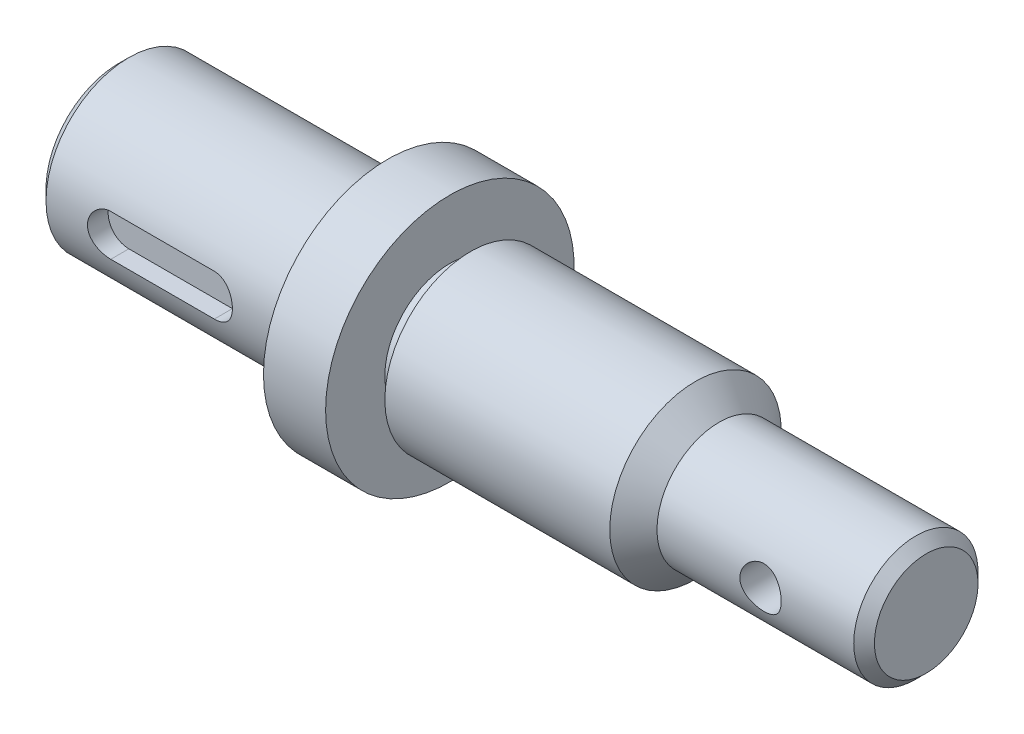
ISO-10303-21;
HEADER;
FILE_DESCRIPTION(('STEP AP214'),'2;1');
FILE_NAME('part.step','',(''),(''),'','','');
FILE_SCHEMA(('AUTOMOTIVE_DESIGN { 1 0 10303 214 1 1 1 1 }'));
ENDSEC;
DATA;
#1=APPLICATION_CONTEXT('core data for automotive mechanical design processes');
#2=APPLICATION_PROTOCOL_DEFINITION('international standard','automotive_design',2000,#1);
#3=PRODUCT_CONTEXT('',#1,'mechanical');
#4=PRODUCT('Part','Part','',(#3));
#5=PRODUCT_RELATED_PRODUCT_CATEGORY('part','',(#4));
#6=PRODUCT_DEFINITION_FORMATION('','',#4);
#7=PRODUCT_DEFINITION_CONTEXT('part definition',#1,'design');
#8=PRODUCT_DEFINITION('design','',#6,#7);
#9=PRODUCT_DEFINITION_SHAPE('','',#8);
#10=(LENGTH_UNIT() NAMED_UNIT(*) SI_UNIT(.MILLI.,.METRE.));
#11=(NAMED_UNIT(*) PLANE_ANGLE_UNIT() SI_UNIT($,.RADIAN.));
#12=(NAMED_UNIT(*) SI_UNIT($,.STERADIAN.) SOLID_ANGLE_UNIT());
#13=UNCERTAINTY_MEASURE_WITH_UNIT(LENGTH_MEASURE(1.E-05),#10,'distance_accuracy_value','');
#14=(GEOMETRIC_REPRESENTATION_CONTEXT(3) GLOBAL_UNCERTAINTY_ASSIGNED_CONTEXT((#13)) GLOBAL_UNIT_ASSIGNED_CONTEXT((#10,
#11,#12)) REPRESENTATION_CONTEXT('',''));
#15=CARTESIAN_POINT('',(0.,0.,0.));
#16=DIRECTION('',(0.,0.,1.));
#17=DIRECTION('',(1.,0.,0.));
#18=AXIS2_PLACEMENT_3D('',#15,#16,#17);
#19=CARTESIAN_POINT('',(0.,0.,0.));
#20=DIRECTION('',(1.,0.,0.));
#21=DIRECTION('',(0.,0.,-1.));
#22=AXIS2_PLACEMENT_3D('',#19,#20,#21);
#23=PLANE('',#22);
#24=CARTESIAN_POINT('',(0.,0.,0.));
#25=DIRECTION('',(1.,0.,0.));
#26=DIRECTION('',(0.,0.,-1.));
#27=AXIS2_PLACEMENT_3D('',#24,#25,#26);
#28=CIRCLE('',#27,3.5);
#29=CARTESIAN_POINT('',(0.,0.,-3.5));
#30=VERTEX_POINT('',#29);
#31=EDGE_CURVE('E138',#30,#30,#28,.F.);
#32=ORIENTED_EDGE('',*,*,#31,.T.);
#33=EDGE_LOOP('',(#32));
#34=FACE_BOUND('',#33,.T.);
#35=ADVANCED_FACE('F31',(#34),#23,.F.);
#36=CARTESIAN_POINT('',(-89.9218390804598,0.,0.));
#37=DIRECTION('',(-1.,0.,0.));
#38=DIRECTION('',(0.,0.,1.));
#39=AXIS2_PLACEMENT_3D('',#36,#37,#38);
#40=CYLINDRICAL_SURFACE('',#39,4.);
#41=DIRECTION('',(-1.,0.,0.));
#42=VECTOR('',#41,1.);
#43=CARTESIAN_POINT('',(-89.9218390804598,1.,3.87298334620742));
#44=LINE('',#43,#42);
#45=CARTESIAN_POINT('',(3.5,1.,3.87298334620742));
#46=VERTEX_POINT('',#45);
#47=CARTESIAN_POINT('',(8.5,1.,3.87298334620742));
#48=VERTEX_POINT('',#47);
#49=EDGE_CURVE('E11',#46,#48,#44,.F.);
#50=ORIENTED_EDGE('',*,*,#49,.T.);
#51=CARTESIAN_POINT('',(8.5,1.,3.87298334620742));
#52=CARTESIAN_POINT('',(8.52766298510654,1.00000033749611,3.87298148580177));
#53=CARTESIAN_POINT('',(8.55531226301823,0.998851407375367,3.87328009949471));
#54=CARTESIAN_POINT('',(8.61040403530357,0.994271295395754,3.87445904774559));
#55=CARTESIAN_POINT('',(8.63784656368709,0.990840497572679,3.87533928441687));
#56=CARTESIAN_POINT('',(8.71945317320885,0.977175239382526,3.87881710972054));
#57=CARTESIAN_POINT('',(8.77305646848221,0.963567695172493,3.88225203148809));
#58=CARTESIAN_POINT('',(8.87712467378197,0.927798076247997,3.89095422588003));
#59=CARTESIAN_POINT('',(8.92758987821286,0.905636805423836,3.8962213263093));
#60=CARTESIAN_POINT('',(9.02411144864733,0.853415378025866,3.90799134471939));
#61=CARTESIAN_POINT('',(9.07016662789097,0.823353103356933,3.91449459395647));
#62=CARTESIAN_POINT('',(9.1575438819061,0.755484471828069,3.92816262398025));
#63=CARTESIAN_POINT('',(9.19875488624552,0.717537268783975,3.93533791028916));
#64=CARTESIAN_POINT('',(9.27430208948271,0.635275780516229,3.94945104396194));
#65=CARTESIAN_POINT('',(9.30863718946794,0.59096047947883,3.95638885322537));
#66=CARTESIAN_POINT('',(9.36991100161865,0.496456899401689,3.96936182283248));
#67=CARTESIAN_POINT('',(9.39673989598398,0.446195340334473,3.9753830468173));
#68=CARTESIAN_POINT('',(9.44152473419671,0.341702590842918,3.98572346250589));
#69=CARTESIAN_POINT('',(9.45948242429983,0.287472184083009,3.99004298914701));
#70=CARTESIAN_POINT('',(9.48565899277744,0.177744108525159,3.99641900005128));
#71=CARTESIAN_POINT('',(9.49406767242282,0.122294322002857,3.99851952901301));
#72=CARTESIAN_POINT('',(9.5015033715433,0.0107327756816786,4.00037438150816));
#73=CARTESIAN_POINT('',(9.50053157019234,-0.0453789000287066,4.00012899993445));
#74=CARTESIAN_POINT('',(9.48937003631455,-0.155352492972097,3.99735237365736));
#75=CARTESIAN_POINT('',(9.47938538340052,-0.209236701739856,3.99487198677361));
#76=CARTESIAN_POINT('',(9.45081132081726,-0.314538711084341,3.98796330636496));
#77=CARTESIAN_POINT('',(9.43222153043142,-0.365956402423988,3.98353492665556));
#78=CARTESIAN_POINT('',(9.38679871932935,-0.46540728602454,3.97314997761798));
#79=CARTESIAN_POINT('',(9.35989260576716,-0.51340562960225,3.96717993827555));
#80=CARTESIAN_POINT('',(9.29865687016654,-0.604276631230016,3.95435945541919));
#81=CARTESIAN_POINT('',(9.26432612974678,-0.64714851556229,3.94750887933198));
#82=CARTESIAN_POINT('',(9.18812108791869,-0.727769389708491,3.93345566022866));
#83=CARTESIAN_POINT('',(9.14606836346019,-0.765349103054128,3.92624850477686));
#84=CARTESIAN_POINT('',(9.05617013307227,-0.832969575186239,3.91246168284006));
#85=CARTESIAN_POINT('',(9.00832304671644,-0.863008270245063,3.90588218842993));
#86=CARTESIAN_POINT('',(8.90785440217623,-0.914804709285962,3.89407813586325));
#87=CARTESIAN_POINT('',(8.85520853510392,-0.93651701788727,3.88886106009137));
#88=CARTESIAN_POINT('',(8.74688307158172,-0.970702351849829,3.88047058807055));
#89=CARTESIAN_POINT('',(8.69120814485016,-0.983189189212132,3.87729413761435));
#90=CARTESIAN_POINT('',(8.6125426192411,-0.993904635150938,3.87455290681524));
#91=CARTESIAN_POINT('',(8.59008029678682,-0.996190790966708,3.8739652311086));
#92=CARTESIAN_POINT('',(8.54508221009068,-0.999236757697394,3.87318062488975));
#93=CARTESIAN_POINT('',(8.52254662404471,-0.999999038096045,3.87298306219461));
#94=CARTESIAN_POINT('',(8.5,-1.,3.87298334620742));
#95=B_SPLINE_CURVE_WITH_KNOTS('',3,(#51,#52,#53,#54,#55,#56,#57,#58,#59,#60,#61,#62,#63,#64,#65,
#66,#67,#68,#69,#70,#71,#72,#73,#74,#75,#76,#77,#78,#79,#80,#81,#82,#83,#84,#85,#86,#87,#88,#89,
#90,#91,#92,#93,#94),.UNSPECIFIED.,.F.,.F.,(4,2,2,2,2,2,2,2,2,2,2,2,2,2,2,2,2,2,2,2,2,4),(0.,
0.082936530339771,0.165859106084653,0.331229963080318,0.496585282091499,0.66198497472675,
0.830641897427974,0.999325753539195,1.17036187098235,1.34136430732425,1.50890481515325,
1.67642426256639,1.84022545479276,2.00403389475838,2.16932509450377,2.33464120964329,
2.50441429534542,2.67423379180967,2.84496720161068,3.01544447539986,3.08315848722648,
3.15076267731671),.UNSPECIFIED.);
#96=CARTESIAN_POINT('',(8.5,-1.,3.87298334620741));
#97=VERTEX_POINT('',#96);
#98=EDGE_CURVE('E150',#48,#97,#95,.T.);
#99=ORIENTED_EDGE('',*,*,#98,.T.);
#100=DIRECTION('',(-1.,0.,0.));
#101=VECTOR('',#100,1.);
#102=CARTESIAN_POINT('',(-89.9218390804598,-1.00000000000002,3.87298334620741));
#103=LINE('',#102,#101);
#104=CARTESIAN_POINT('',(3.5,-1.00000000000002,3.87298334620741));
#105=VERTEX_POINT('',#104);
#106=EDGE_CURVE('E44',#97,#105,#103,.T.);
#107=ORIENTED_EDGE('',*,*,#106,.T.);
#108=CARTESIAN_POINT('',(3.5,-1.,3.87298334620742));
#109=CARTESIAN_POINT('',(3.47233701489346,-1.00000033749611,3.87298148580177));
#110=CARTESIAN_POINT('',(3.44468773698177,-0.998851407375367,3.87328009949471));
#111=CARTESIAN_POINT('',(3.38959596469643,-0.994271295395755,3.87445904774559));
#112=CARTESIAN_POINT('',(3.36215343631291,-0.99084049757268,3.87533928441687));
#113=CARTESIAN_POINT('',(3.28054682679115,-0.977175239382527,3.87881710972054));
#114=CARTESIAN_POINT('',(3.22694353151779,-0.963567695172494,3.88225203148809));
#115=CARTESIAN_POINT('',(3.12287532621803,-0.927798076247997,3.89095422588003));
#116=CARTESIAN_POINT('',(3.07241012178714,-0.905636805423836,3.8962213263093));
#117=CARTESIAN_POINT('',(2.97588855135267,-0.853415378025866,3.90799134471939));
#118=CARTESIAN_POINT('',(2.92983337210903,-0.823353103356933,3.91449459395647));
#119=CARTESIAN_POINT('',(2.8424561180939,-0.755484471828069,3.92816262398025));
#120=CARTESIAN_POINT('',(2.80124511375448,-0.717537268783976,3.93533791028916));
#121=CARTESIAN_POINT('',(2.72569791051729,-0.63527578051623,3.94945104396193));
#122=CARTESIAN_POINT('',(2.69136281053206,-0.590960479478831,3.95638885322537));
#123=CARTESIAN_POINT('',(2.63008899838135,-0.496456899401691,3.96936182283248));
#124=CARTESIAN_POINT('',(2.60326010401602,-0.446195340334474,3.9753830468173));
#125=CARTESIAN_POINT('',(2.55847526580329,-0.341702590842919,3.98572346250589));
#126=CARTESIAN_POINT('',(2.54051757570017,-0.28747218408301,3.99004298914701));
#127=CARTESIAN_POINT('',(2.51434100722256,-0.17774410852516,3.99641900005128));
#128=CARTESIAN_POINT('',(2.50593232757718,-0.122294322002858,3.99851952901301));
#129=CARTESIAN_POINT('',(2.4984966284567,-0.0107327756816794,4.00037438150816));
#130=CARTESIAN_POINT('',(2.49946842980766,0.0453789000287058,4.00012899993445));
#131=CARTESIAN_POINT('',(2.51062996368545,0.155352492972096,3.99735237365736));
#132=CARTESIAN_POINT('',(2.52061461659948,0.209236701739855,3.99487198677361));
#133=CARTESIAN_POINT('',(2.54918867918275,0.31453871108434,3.98796330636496));
#134=CARTESIAN_POINT('',(2.56777846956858,0.365956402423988,3.98353492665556));
#135=CARTESIAN_POINT('',(2.61320128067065,0.465407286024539,3.97314997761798));
#136=CARTESIAN_POINT('',(2.64010739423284,0.513405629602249,3.96717993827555));
#137=CARTESIAN_POINT('',(2.70134312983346,0.604276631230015,3.95435945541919));
#138=CARTESIAN_POINT('',(2.73567387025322,0.647148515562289,3.94750887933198));
#139=CARTESIAN_POINT('',(2.81187891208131,0.727769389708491,3.93345566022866));
#140=CARTESIAN_POINT('',(2.85393163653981,0.765349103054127,3.92624850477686));
#141=CARTESIAN_POINT('',(2.94382986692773,0.832969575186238,3.91246168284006));
#142=CARTESIAN_POINT('',(2.99167695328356,0.863008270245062,3.90588218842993));
#143=CARTESIAN_POINT('',(3.09214559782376,0.914804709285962,3.89407813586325));
#144=CARTESIAN_POINT('',(3.14479146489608,0.93651701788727,3.88886106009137));
#145=CARTESIAN_POINT('',(3.25311692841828,0.970702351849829,3.88047058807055));
#146=CARTESIAN_POINT('',(3.30879185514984,0.983189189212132,3.87729413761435));
#147=CARTESIAN_POINT('',(3.3874573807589,0.993904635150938,3.87455290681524));
#148=CARTESIAN_POINT('',(3.40991970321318,0.996190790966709,3.8739652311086));
#149=CARTESIAN_POINT('',(3.45491778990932,0.999236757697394,3.87318062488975));
#150=CARTESIAN_POINT('',(3.47745337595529,0.999999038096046,3.87298306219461));
#151=CARTESIAN_POINT('',(3.5,1.,3.87298334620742));
#152=B_SPLINE_CURVE_WITH_KNOTS('',3,(#108,#109,#110,#111,#112,#113,#114,#115,#116,#117,#118,
#119,#120,#121,#122,#123,#124,#125,#126,#127,#128,#129,#130,#131,#132,#133,#134,#135,#136,#137,
#138,#139,#140,#141,#142,#143,#144,#145,#146,#147,#148,#149,#150,#151),.UNSPECIFIED.,.F.,.F.,(4,
2,2,2,2,2,2,2,2,2,2,2,2,2,2,2,2,2,2,2,2,4),(0.,0.0829365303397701,0.165859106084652,
0.331229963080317,0.496585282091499,0.66198497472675,0.830641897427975,0.999325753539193,
1.17036187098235,1.34136430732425,1.50890481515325,1.67642426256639,1.84022545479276,
2.00403389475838,2.16932509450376,2.33464120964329,2.50441429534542,2.67423379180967,
2.84496720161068,3.01544447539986,3.08315848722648,3.15076267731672),.UNSPECIFIED.);
#153=EDGE_CURVE('E52',#105,#46,#152,.T.);
#154=ORIENTED_EDGE('',*,*,#153,.T.);
#155=EDGE_LOOP('',(#50,#99,#107,#154));
#156=FACE_BOUND('',#155,.T.);
#157=CARTESIAN_POINT('',(0.5,0.,0.));
#158=DIRECTION('',(1.,0.,0.));
#159=DIRECTION('',(0.,0.,-1.));
#160=AXIS2_PLACEMENT_3D('',#157,#158,#159);
#161=CIRCLE('',#160,4.);
#162=CARTESIAN_POINT('',(0.5,0.,-4.));
#163=VERTEX_POINT('',#162);
#164=EDGE_CURVE('E141',#163,#163,#161,.T.);
#165=ORIENTED_EDGE('',*,*,#164,.T.);
#166=EDGE_LOOP('',(#165));
#167=FACE_BOUND('',#166,.T.);
#168=CARTESIAN_POINT('',(12.,0.,0.));
#169=DIRECTION('',(-1.,0.,0.));
#170=DIRECTION('',(0.,0.,1.));
#171=AXIS2_PLACEMENT_3D('',#168,#169,#170);
#172=CIRCLE('',#171,4.);
#173=CARTESIAN_POINT('',(12.,0.,4.));
#174=VERTEX_POINT('',#173);
#175=EDGE_CURVE('E135',#174,#174,#172,.T.);
#176=ORIENTED_EDGE('',*,*,#175,.T.);
#177=EDGE_LOOP('',(#176));
#178=FACE_BOUND('',#177,.T.);
#179=ADVANCED_FACE('F163',(#156,#167,#178),#40,.T.);
#180=CARTESIAN_POINT('',(12.,4.,0.));
#181=DIRECTION('',(-1.,0.,0.));
#182=DIRECTION('',(0.,0.,1.));
#183=AXIS2_PLACEMENT_3D('',#180,#181,#182);
#184=PLANE('',#183);
#185=ORIENTED_EDGE('',*,*,#175,.F.);
#186=EDGE_LOOP('',(#185));
#187=FACE_BOUND('',#186,.T.);
#188=CARTESIAN_POINT('',(12.,0.,0.));
#189=DIRECTION('',(-1.,0.,0.));
#190=DIRECTION('',(0.,0.,1.));
#191=AXIS2_PLACEMENT_3D('',#188,#189,#190);
#192=CIRCLE('',#191,3.);
#193=CARTESIAN_POINT('',(12.,0.,3.));
#194=VERTEX_POINT('',#193);
#195=EDGE_CURVE('E132',#194,#194,#192,.T.);
#196=ORIENTED_EDGE('',*,*,#195,.T.);
#197=EDGE_LOOP('',(#196));
#198=FACE_BOUND('',#197,.T.);
#199=ADVANCED_FACE('F207',(#187,#198),#184,.F.);
#200=CARTESIAN_POINT('',(-89.9218390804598,0.,0.));
#201=DIRECTION('',(-1.,0.,0.));
#202=DIRECTION('',(0.,0.,1.));
#203=AXIS2_PLACEMENT_3D('',#200,#201,#202);
#204=CYLINDRICAL_SURFACE('',#203,3.);
#205=ORIENTED_EDGE('',*,*,#195,.F.);
#206=EDGE_LOOP('',(#205));
#207=FACE_BOUND('',#206,.T.);
#208=CARTESIAN_POINT('',(13.,0.,0.));
#209=DIRECTION('',(-1.,0.,0.));
#210=DIRECTION('',(0.,0.,1.));
#211=AXIS2_PLACEMENT_3D('',#208,#209,#210);
#212=CIRCLE('',#211,3.);
#213=CARTESIAN_POINT('',(13.,0.,3.));
#214=VERTEX_POINT('',#213);
#215=EDGE_CURVE('E129',#214,#214,#212,.T.);
#216=ORIENTED_EDGE('',*,*,#215,.T.);
#217=EDGE_LOOP('',(#216));
#218=FACE_BOUND('',#217,.T.);
#219=ADVANCED_FACE('F224',(#207,#218),#204,.T.);
#220=CARTESIAN_POINT('',(13.,3.,0.));
#221=DIRECTION('',(1.,0.,0.));
#222=DIRECTION('',(0.,0.,-1.));
#223=AXIS2_PLACEMENT_3D('',#220,#221,#222);
#224=PLANE('',#223);
#225=ORIENTED_EDGE('',*,*,#215,.F.);
#226=EDGE_LOOP('',(#225));
#227=FACE_BOUND('',#226,.T.);
#228=CARTESIAN_POINT('',(13.,0.,0.));
#229=DIRECTION('',(-1.,0.,0.));
#230=DIRECTION('',(0.,0.,1.));
#231=AXIS2_PLACEMENT_3D('',#228,#229,#230);
#232=CIRCLE('',#231,6.);
#233=CARTESIAN_POINT('',(13.,0.,6.));
#234=VERTEX_POINT('',#233);
#235=EDGE_CURVE('E126',#234,#234,#232,.T.);
#236=ORIENTED_EDGE('',*,*,#235,.T.);
#237=EDGE_LOOP('',(#236));
#238=FACE_BOUND('',#237,.T.);
#239=ADVANCED_FACE('F229',(#227,#238),#224,.F.);
#240=CARTESIAN_POINT('',(-89.9218390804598,0.,0.));
#241=DIRECTION('',(-1.,0.,0.));
#242=DIRECTION('',(0.,0.,1.));
#243=AXIS2_PLACEMENT_3D('',#240,#241,#242);
#244=CYLINDRICAL_SURFACE('',#243,6.);
#245=ORIENTED_EDGE('',*,*,#235,.F.);
#246=EDGE_LOOP('',(#245));
#247=FACE_BOUND('',#246,.T.);
#248=CARTESIAN_POINT('',(16.,0.,0.));
#249=DIRECTION('',(-1.,0.,0.));
#250=DIRECTION('',(0.,0.,1.));
#251=AXIS2_PLACEMENT_3D('',#248,#249,#250);
#252=CIRCLE('',#251,6.);
#253=CARTESIAN_POINT('',(16.,0.,6.));
#254=VERTEX_POINT('',#253);
#255=EDGE_CURVE('E123',#254,#254,#252,.T.);
#256=ORIENTED_EDGE('',*,*,#255,.T.);
#257=EDGE_LOOP('',(#256));
#258=FACE_BOUND('',#257,.T.);
#259=ADVANCED_FACE('F235',(#247,#258),#244,.T.);
#260=CARTESIAN_POINT('',(16.,6.,0.));
#261=DIRECTION('',(-1.,0.,0.));
#262=DIRECTION('',(0.,0.,1.));
#263=AXIS2_PLACEMENT_3D('',#260,#261,#262);
#264=PLANE('',#263);
#265=ORIENTED_EDGE('',*,*,#255,.F.);
#266=EDGE_LOOP('',(#265));
#267=FACE_BOUND('',#266,.T.);
#268=CARTESIAN_POINT('',(16.,0.,0.));
#269=DIRECTION('',(-1.,0.,0.));
#270=DIRECTION('',(0.,0.,1.));
#271=AXIS2_PLACEMENT_3D('',#268,#269,#270);
#272=CIRCLE('',#271,3.1400325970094);
#273=CARTESIAN_POINT('',(16.,0.,3.1400325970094));
#274=VERTEX_POINT('',#273);
#275=EDGE_CURVE('E120',#274,#274,#272,.T.);
#276=ORIENTED_EDGE('',*,*,#275,.T.);
#277=EDGE_LOOP('',(#276));
#278=FACE_BOUND('',#277,.T.);
#279=ADVANCED_FACE('F241',(#267,#278),#264,.F.);
#280=CARTESIAN_POINT('',(-89.9218390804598,0.,0.));
#281=DIRECTION('',(-1.,0.,0.));
#282=DIRECTION('',(0.,0.,1.));
#283=AXIS2_PLACEMENT_3D('',#280,#281,#282);
#284=CYLINDRICAL_SURFACE('',#283,3.1400325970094);
#285=ORIENTED_EDGE('',*,*,#275,.F.);
#286=EDGE_LOOP('',(#285));
#287=FACE_BOUND('',#286,.T.);
#288=CARTESIAN_POINT('',(17.,0.,0.));
#289=DIRECTION('',(-1.,0.,0.));
#290=DIRECTION('',(0.,0.,1.));
#291=AXIS2_PLACEMENT_3D('',#288,#289,#290);
#292=CIRCLE('',#291,3.1400325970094);
#293=CARTESIAN_POINT('',(17.,0.,3.1400325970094));
#294=VERTEX_POINT('',#293);
#295=EDGE_CURVE('E117',#294,#294,#292,.T.);
#296=ORIENTED_EDGE('',*,*,#295,.T.);
#297=EDGE_LOOP('',(#296));
#298=FACE_BOUND('',#297,.T.);
#299=ADVANCED_FACE('F247',(#287,#298),#284,.T.);
#300=CARTESIAN_POINT('',(17.,3.1400325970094,0.));
#301=DIRECTION('',(1.,0.,0.));
#302=DIRECTION('',(0.,0.,-1.));
#303=AXIS2_PLACEMENT_3D('',#300,#301,#302);
#304=PLANE('',#303);
#305=ORIENTED_EDGE('',*,*,#295,.F.);
#306=EDGE_LOOP('',(#305));
#307=FACE_BOUND('',#306,.T.);
#308=CARTESIAN_POINT('',(17.,0.,0.));
#309=DIRECTION('',(-1.,0.,0.));
#310=DIRECTION('',(0.,0.,1.));
#311=AXIS2_PLACEMENT_3D('',#308,#309,#310);
#312=CIRCLE('',#311,4.1400325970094);
#313=CARTESIAN_POINT('',(17.,0.,4.1400325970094));
#314=VERTEX_POINT('',#313);
#315=EDGE_CURVE('E114',#314,#314,#312,.T.);
#316=ORIENTED_EDGE('',*,*,#315,.T.);
#317=EDGE_LOOP('',(#316));
#318=FACE_BOUND('',#317,.T.);
#319=ADVANCED_FACE('F253',(#307,#318),#304,.F.);
#320=CARTESIAN_POINT('',(-89.9218390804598,0.,0.));
#321=DIRECTION('',(-1.,0.,0.));
#322=DIRECTION('',(0.,0.,1.));
#323=AXIS2_PLACEMENT_3D('',#320,#321,#322);
#324=CYLINDRICAL_SURFACE('',#323,4.1400325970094);
#325=ORIENTED_EDGE('',*,*,#315,.F.);
#326=EDGE_LOOP('',(#325));
#327=FACE_BOUND('',#326,.T.);
#328=CARTESIAN_POINT('',(27.8599674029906,0.,0.));
#329=DIRECTION('',(-1.,0.,0.));
#330=DIRECTION('',(0.,0.,1.));
#331=AXIS2_PLACEMENT_3D('',#328,#329,#330);
#332=CIRCLE('',#331,4.1400325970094);
#333=CARTESIAN_POINT('',(27.8599674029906,0.,4.1400325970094));
#334=VERTEX_POINT('',#333);
#335=EDGE_CURVE('E111',#334,#334,#332,.T.);
#336=ORIENTED_EDGE('',*,*,#335,.T.);
#337=EDGE_LOOP('',(#336));
#338=FACE_BOUND('',#337,.T.);
#339=ADVANCED_FACE('F259',(#327,#338),#324,.T.);
#340=CARTESIAN_POINT('',(29.,0.,0.));
#341=DIRECTION('',(-1.,0.,0.));
#342=DIRECTION('',(0.,0.,1.));
#343=AXIS2_PLACEMENT_3D('',#340,#341,#342);
#344=CONICAL_SURFACE('',#343,3.,0.785398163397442);
#345=ORIENTED_EDGE('',*,*,#335,.F.);
#346=EDGE_LOOP('',(#345));
#347=FACE_BOUND('',#346,.T.);
#348=CARTESIAN_POINT('',(29.,0.,0.));
#349=DIRECTION('',(-1.,0.,0.));
#350=DIRECTION('',(0.,0.,1.));
#351=AXIS2_PLACEMENT_3D('',#348,#349,#350);
#352=CIRCLE('',#351,3.);
#353=CARTESIAN_POINT('',(29.,0.,3.));
#354=VERTEX_POINT('',#353);
#355=EDGE_CURVE('E105',#354,#354,#352,.T.);
#356=ORIENTED_EDGE('',*,*,#355,.T.);
#357=EDGE_LOOP('',(#356));
#358=FACE_BOUND('',#357,.T.);
#359=ADVANCED_FACE('F187',(#347,#358),#344,.T.);
#360=CARTESIAN_POINT('',(-89.9218390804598,0.,0.));
#361=DIRECTION('',(-1.,0.,0.));
#362=DIRECTION('',(0.,0.,1.));
#363=AXIS2_PLACEMENT_3D('',#360,#361,#362);
#364=CYLINDRICAL_SURFACE('',#363,3.);
#365=CARTESIAN_POINT('',(35.,0.,3.));
#366=CARTESIAN_POINT('',(35.0000002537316,-0.0545633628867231,3.00000015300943));
#367=CARTESIAN_POINT('',(34.9955197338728,-0.10912519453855,2.99849769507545));
#368=CARTESIAN_POINT('',(34.9777708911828,-0.216641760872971,2.99265210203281));
#369=CARTESIAN_POINT('',(34.9645016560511,-0.269596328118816,2.98830867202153));
#370=CARTESIAN_POINT('',(34.929680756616,-0.372332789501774,2.97725307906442));
#371=CARTESIAN_POINT('',(34.9081429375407,-0.422119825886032,2.97054487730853));
#372=CARTESIAN_POINT('',(34.8574588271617,-0.517374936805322,2.95544445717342));
#373=CARTESIAN_POINT('',(34.8283110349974,-0.562842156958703,2.94705190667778));
#374=CARTESIAN_POINT('',(34.7621741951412,-0.649741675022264,2.92914094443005));
#375=CARTESIAN_POINT('',(34.7249687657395,-0.691003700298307,2.91959556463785));
#376=CARTESIAN_POINT('',(34.6442328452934,-0.766832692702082,2.90060314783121));
#377=CARTESIAN_POINT('',(34.6007009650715,-0.801398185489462,2.89115613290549));
#378=CARTESIAN_POINT('',(34.5070148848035,-0.863824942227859,2.87313332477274));
#379=CARTESIAN_POINT('',(34.4567062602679,-0.891464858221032,2.86459039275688));
#380=CARTESIAN_POINT('',(34.3518239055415,-0.93781887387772,2.84975305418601));
#381=CARTESIAN_POINT('',(34.2972514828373,-0.956535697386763,2.84345796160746));
#382=CARTESIAN_POINT('',(34.1873267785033,-0.983873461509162,2.83411303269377));
#383=CARTESIAN_POINT('',(34.1320627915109,-0.992813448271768,2.83096095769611));
#384=CARTESIAN_POINT('',(34.0207362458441,-1.00134112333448,2.82795656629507));
#385=CARTESIAN_POINT('',(33.9646739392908,-1.00093170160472,2.8281032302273));
#386=CARTESIAN_POINT('',(33.856063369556,-0.991019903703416,2.8315901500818));
#387=CARTESIAN_POINT('',(33.803471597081,-0.981933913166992,2.83478415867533));
#388=CARTESIAN_POINT('',(33.7006065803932,-0.955606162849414,2.84376657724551));
#389=CARTESIAN_POINT('',(33.6503336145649,-0.938363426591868,2.84955529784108));
#390=CARTESIAN_POINT('',(33.5525872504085,-0.89593905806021,2.86317911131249));
#391=CARTESIAN_POINT('',(33.5051719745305,-0.870634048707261,2.87104565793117));
#392=CARTESIAN_POINT('',(33.4151290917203,-0.812889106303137,2.88792558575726));
#393=CARTESIAN_POINT('',(33.3725028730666,-0.780447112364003,2.89693929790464));
#394=CARTESIAN_POINT('',(33.2909084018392,-0.707349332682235,2.91567329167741));
#395=CARTESIAN_POINT('',(33.2522473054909,-0.66635315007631,2.92540589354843));
#396=CARTESIAN_POINT('',(33.1822687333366,-0.578339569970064,2.94406938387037));
#397=CARTESIAN_POINT('',(33.1509519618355,-0.531321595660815,2.95300019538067));
#398=CARTESIAN_POINT('',(33.0963036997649,-0.431947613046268,2.96917107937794));
#399=CARTESIAN_POINT('',(33.0730545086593,-0.379543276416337,2.97639350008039));
#400=CARTESIAN_POINT('',(33.0357968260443,-0.271269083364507,2.98820567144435));
#401=CARTESIAN_POINT('',(33.0217851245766,-0.215400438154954,2.99279633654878));
#402=CARTESIAN_POINT('',(33.0039443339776,-0.104383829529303,2.99867627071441));
#403=CARTESIAN_POINT('',(32.9997001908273,-0.049309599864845,3.00010001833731));
#404=CARTESIAN_POINT('',(33.0003326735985,0.0607750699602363,2.99988902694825));
#405=CARTESIAN_POINT('',(33.0052077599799,0.115785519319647,2.99825480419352));
#406=CARTESIAN_POINT('',(33.023611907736,0.222519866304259,2.99220024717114));
#407=CARTESIAN_POINT('',(33.0368862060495,0.274292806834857,2.98786198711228));
#408=CARTESIAN_POINT('',(33.0713934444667,0.374855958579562,2.97691846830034));
#409=CARTESIAN_POINT('',(33.0926273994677,0.42364578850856,2.97031292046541));
#410=CARTESIAN_POINT('',(33.1430704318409,0.51828829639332,2.95528931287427));
#411=CARTESIAN_POINT('',(33.1724745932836,0.564029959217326,2.94682814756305));
#412=CARTESIAN_POINT('',(33.2381941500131,0.650064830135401,2.92905253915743));
#413=CARTESIAN_POINT('',(33.2745116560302,0.690356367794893,2.91973783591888));
#414=CARTESIAN_POINT('',(33.3549787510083,0.766252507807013,2.90076847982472));
#415=CARTESIAN_POINT('',(33.3994092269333,0.801560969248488,2.89111761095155));
#416=CARTESIAN_POINT('',(33.4937715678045,0.864257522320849,2.87299973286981));
#417=CARTESIAN_POINT('',(33.5437034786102,0.891645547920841,2.8645327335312));
#418=CARTESIAN_POINT('',(33.6476730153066,0.937596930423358,2.84982391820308));
#419=CARTESIAN_POINT('',(33.7017020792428,0.956178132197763,2.84357760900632));
#420=CARTESIAN_POINT('',(33.8123786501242,0.98389466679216,2.83410832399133));
#421=CARTESIAN_POINT('',(33.8690249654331,0.993034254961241,2.83088398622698));
#422=CARTESIAN_POINT('',(33.9801970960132,1.00127628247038,2.82797858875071));
#423=CARTESIAN_POINT('',(34.0346823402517,1.00087025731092,2.82812400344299));
#424=CARTESIAN_POINT('',(34.1427650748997,0.991242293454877,2.8315126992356));
#425=CARTESIAN_POINT('',(34.1963626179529,0.982020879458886,2.83475579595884));
#426=CARTESIAN_POINT('',(34.3001356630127,0.95537181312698,2.84384524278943));
#427=CARTESIAN_POINT('',(34.3503568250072,0.938103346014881,2.84964098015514));
#428=CARTESIAN_POINT('',(34.4472274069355,0.895979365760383,2.86316398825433));
#429=CARTESIAN_POINT('',(34.4938760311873,0.871122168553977,2.87089168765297));
#430=CARTESIAN_POINT('',(34.5844836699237,0.813260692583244,2.8878282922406));
#431=CARTESIAN_POINT('',(34.6282365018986,0.779948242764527,2.89708711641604));
#432=CARTESIAN_POINT('',(34.709689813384,0.706642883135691,2.91583356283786));
#433=CARTESIAN_POINT('',(34.747388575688,0.666648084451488,2.92532124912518));
#434=CARTESIAN_POINT('',(34.8171444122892,0.579241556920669,2.94390030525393));
#435=CARTESIAN_POINT('',(34.848924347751,0.531601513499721,2.95296181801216));
#436=CARTESIAN_POINT('',(34.9039904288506,0.431357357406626,2.96925991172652));
#437=CARTESIAN_POINT('',(34.927278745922,0.378754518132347,2.9764969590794));
#438=CARTESIAN_POINT('',(34.9637216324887,0.272493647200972,2.98805515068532));
#439=CARTESIAN_POINT('',(34.9772824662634,0.218987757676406,2.9924921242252));
#440=CARTESIAN_POINT('',(34.9954202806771,0.110320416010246,2.99846407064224));
#441=CARTESIAN_POINT('',(34.9999997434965,0.0551594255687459,2.99999984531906));
#442=CARTESIAN_POINT('',(35.,0.,3.));
#443=B_SPLINE_CURVE_WITH_KNOTS('',3,(#365,#366,#367,#368,#369,#370,#371,#372,#373,#374,#375,
#376,#377,#378,#379,#380,#381,#382,#383,#384,#385,#386,#387,#388,#389,#390,#391,#392,#393,#394,
#395,#396,#397,#398,#399,#400,#401,#402,#403,#404,#405,#406,#407,#408,#409,#410,#411,#412,#413,
#414,#415,#416,#417,#418,#419,#420,#421,#422,#423,#424,#425,#426,#427,#428,#429,#430,#431,#432,
#433,#434,#435,#436,#437,#438,#439,#440,#441,#442),.UNSPECIFIED.,.T.,.F.,(4,2,2,2,2,2,2,2,2,2,2,
2,2,2,2,2,2,2,2,2,2,2,2,2,2,2,2,2,2,2,2,2,2,2,2,2,2,2,4),(0.,0.16348710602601,0.326991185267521,
0.490222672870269,0.653486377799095,0.82184684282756,0.990244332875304,1.16348384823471,
1.33667044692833,1.5040192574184,1.67131633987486,1.83096826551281,1.99063930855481,
2.15288171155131,2.31517102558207,2.48593305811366,2.65671145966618,2.82918405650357,
3.00159668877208,3.16653583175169,3.33144713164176,3.49158157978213,3.65173645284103,
3.81610399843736,3.9805218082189,4.15241022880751,4.32430008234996,4.49584013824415,
4.66730284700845,4.82995666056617,4.99260079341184,5.15215587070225,5.31174638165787,
5.47830066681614,5.64490211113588,5.81799660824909,5.99104681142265,6.15636558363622,
6.32163866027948),.UNSPECIFIED.);
#444=CARTESIAN_POINT('',(35.,0.,3.));
#445=VERTEX_POINT('',#444);
#446=EDGE_CURVE('E35',#445,#445,#443,.T.);
#447=ORIENTED_EDGE('',*,*,#446,.T.);
#448=EDGE_LOOP('',(#447));
#449=FACE_BOUND('',#448,.T.);
#450=CARTESIAN_POINT('',(35.,0.,-3.));
#451=CARTESIAN_POINT('',(35.0000002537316,0.0545633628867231,-3.00000015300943));
#452=CARTESIAN_POINT('',(34.9955197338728,0.10912519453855,-2.99849769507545));
#453=CARTESIAN_POINT('',(34.9777708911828,0.216641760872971,-2.99265210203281));
#454=CARTESIAN_POINT('',(34.9645016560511,0.269596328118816,-2.98830867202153));
#455=CARTESIAN_POINT('',(34.929680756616,0.372332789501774,-2.97725307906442));
#456=CARTESIAN_POINT('',(34.9081429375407,0.422119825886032,-2.97054487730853));
#457=CARTESIAN_POINT('',(34.8574588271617,0.517374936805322,-2.95544445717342));
#458=CARTESIAN_POINT('',(34.8283110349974,0.562842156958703,-2.94705190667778));
#459=CARTESIAN_POINT('',(34.7621741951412,0.649741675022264,-2.92914094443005));
#460=CARTESIAN_POINT('',(34.7249687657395,0.691003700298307,-2.91959556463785));
#461=CARTESIAN_POINT('',(34.6442328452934,0.766832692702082,-2.90060314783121));
#462=CARTESIAN_POINT('',(34.6007009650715,0.801398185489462,-2.89115613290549));
#463=CARTESIAN_POINT('',(34.5070148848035,0.863824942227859,-2.87313332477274));
#464=CARTESIAN_POINT('',(34.4567062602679,0.891464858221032,-2.86459039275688));
#465=CARTESIAN_POINT('',(34.3518239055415,0.93781887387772,-2.84975305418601));
#466=CARTESIAN_POINT('',(34.2972514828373,0.956535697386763,-2.84345796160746));
#467=CARTESIAN_POINT('',(34.1873267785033,0.983873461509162,-2.83411303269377));
#468=CARTESIAN_POINT('',(34.1320627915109,0.992813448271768,-2.83096095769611));
#469=CARTESIAN_POINT('',(34.0207362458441,1.00134112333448,-2.82795656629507));
#470=CARTESIAN_POINT('',(33.9646739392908,1.00093170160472,-2.8281032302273));
#471=CARTESIAN_POINT('',(33.856063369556,0.991019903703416,-2.8315901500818));
#472=CARTESIAN_POINT('',(33.803471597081,0.981933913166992,-2.83478415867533));
#473=CARTESIAN_POINT('',(33.7006065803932,0.955606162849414,-2.84376657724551));
#474=CARTESIAN_POINT('',(33.6503336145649,0.938363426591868,-2.84955529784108));
#475=CARTESIAN_POINT('',(33.5525872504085,0.89593905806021,-2.86317911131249));
#476=CARTESIAN_POINT('',(33.5051719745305,0.870634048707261,-2.87104565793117));
#477=CARTESIAN_POINT('',(33.4151290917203,0.812889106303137,-2.88792558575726));
#478=CARTESIAN_POINT('',(33.3725028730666,0.780447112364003,-2.89693929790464));
#479=CARTESIAN_POINT('',(33.2909084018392,0.707349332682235,-2.91567329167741));
#480=CARTESIAN_POINT('',(33.2522473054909,0.66635315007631,-2.92540589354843));
#481=CARTESIAN_POINT('',(33.1822687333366,0.578339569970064,-2.94406938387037));
#482=CARTESIAN_POINT('',(33.1509519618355,0.531321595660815,-2.95300019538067));
#483=CARTESIAN_POINT('',(33.0963036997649,0.431947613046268,-2.96917107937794));
#484=CARTESIAN_POINT('',(33.0730545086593,0.379543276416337,-2.97639350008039));
#485=CARTESIAN_POINT('',(33.0357968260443,0.271269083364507,-2.98820567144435));
#486=CARTESIAN_POINT('',(33.0217851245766,0.215400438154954,-2.99279633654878));
#487=CARTESIAN_POINT('',(33.0039443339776,0.104383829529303,-2.99867627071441));
#488=CARTESIAN_POINT('',(32.9997001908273,0.049309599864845,-3.00010001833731));
#489=CARTESIAN_POINT('',(33.0003326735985,-0.0607750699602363,-2.99988902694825));
#490=CARTESIAN_POINT('',(33.0052077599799,-0.115785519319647,-2.99825480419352));
#491=CARTESIAN_POINT('',(33.023611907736,-0.222519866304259,-2.99220024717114));
#492=CARTESIAN_POINT('',(33.0368862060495,-0.274292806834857,-2.98786198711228));
#493=CARTESIAN_POINT('',(33.0713934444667,-0.374855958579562,-2.97691846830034));
#494=CARTESIAN_POINT('',(33.0926273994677,-0.42364578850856,-2.97031292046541));
#495=CARTESIAN_POINT('',(33.1430704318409,-0.51828829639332,-2.95528931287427));
#496=CARTESIAN_POINT('',(33.1724745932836,-0.564029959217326,-2.94682814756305));
#497=CARTESIAN_POINT('',(33.2381941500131,-0.650064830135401,-2.92905253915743));
#498=CARTESIAN_POINT('',(33.2745116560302,-0.690356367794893,-2.91973783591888));
#499=CARTESIAN_POINT('',(33.3549787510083,-0.766252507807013,-2.90076847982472));
#500=CARTESIAN_POINT('',(33.3994092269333,-0.801560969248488,-2.89111761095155));
#501=CARTESIAN_POINT('',(33.4937715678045,-0.864257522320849,-2.87299973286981));
#502=CARTESIAN_POINT('',(33.5437034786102,-0.891645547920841,-2.8645327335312));
#503=CARTESIAN_POINT('',(33.6476730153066,-0.937596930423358,-2.84982391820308));
#504=CARTESIAN_POINT('',(33.7017020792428,-0.956178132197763,-2.84357760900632));
#505=CARTESIAN_POINT('',(33.8123786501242,-0.98389466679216,-2.83410832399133));
#506=CARTESIAN_POINT('',(33.8690249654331,-0.993034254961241,-2.83088398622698));
#507=CARTESIAN_POINT('',(33.9801970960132,-1.00127628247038,-2.82797858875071));
#508=CARTESIAN_POINT('',(34.0346823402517,-1.00087025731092,-2.82812400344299));
#509=CARTESIAN_POINT('',(34.1427650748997,-0.991242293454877,-2.8315126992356));
#510=CARTESIAN_POINT('',(34.1963626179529,-0.982020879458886,-2.83475579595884));
#511=CARTESIAN_POINT('',(34.3001356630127,-0.95537181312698,-2.84384524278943));
#512=CARTESIAN_POINT('',(34.3503568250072,-0.938103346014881,-2.84964098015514));
#513=CARTESIAN_POINT('',(34.4472274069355,-0.895979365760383,-2.86316398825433));
#514=CARTESIAN_POINT('',(34.4938760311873,-0.871122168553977,-2.87089168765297));
#515=CARTESIAN_POINT('',(34.5844836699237,-0.813260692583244,-2.8878282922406));
#516=CARTESIAN_POINT('',(34.6282365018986,-0.779948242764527,-2.89708711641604));
#517=CARTESIAN_POINT('',(34.709689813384,-0.706642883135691,-2.91583356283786));
#518=CARTESIAN_POINT('',(34.747388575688,-0.666648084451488,-2.92532124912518));
#519=CARTESIAN_POINT('',(34.8171444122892,-0.579241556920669,-2.94390030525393));
#520=CARTESIAN_POINT('',(34.848924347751,-0.531601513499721,-2.95296181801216));
#521=CARTESIAN_POINT('',(34.9039904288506,-0.431357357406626,-2.96925991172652));
#522=CARTESIAN_POINT('',(34.927278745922,-0.378754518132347,-2.9764969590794));
#523=CARTESIAN_POINT('',(34.9637216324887,-0.272493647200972,-2.98805515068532));
#524=CARTESIAN_POINT('',(34.9772824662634,-0.218987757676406,-2.9924921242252));
#525=CARTESIAN_POINT('',(34.9954202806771,-0.110320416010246,-2.99846407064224));
#526=CARTESIAN_POINT('',(34.9999997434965,-0.0551594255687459,-2.99999984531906));
#527=CARTESIAN_POINT('',(35.,0.,-3.));
#528=B_SPLINE_CURVE_WITH_KNOTS('',3,(#450,#451,#452,#453,#454,#455,#456,#457,#458,#459,#460,
#461,#462,#463,#464,#465,#466,#467,#468,#469,#470,#471,#472,#473,#474,#475,#476,#477,#478,#479,
#480,#481,#482,#483,#484,#485,#486,#487,#488,#489,#490,#491,#492,#493,#494,#495,#496,#497,#498,
#499,#500,#501,#502,#503,#504,#505,#506,#507,#508,#509,#510,#511,#512,#513,#514,#515,#516,#517,
#518,#519,#520,#521,#522,#523,#524,#525,#526,#527),.UNSPECIFIED.,.T.,.F.,(4,2,2,2,2,2,2,2,2,2,2,
2,2,2,2,2,2,2,2,2,2,2,2,2,2,2,2,2,2,2,2,2,2,2,2,2,2,2,4),(0.,0.16348710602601,0.326991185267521,
0.490222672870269,0.653486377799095,0.82184684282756,0.990244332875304,1.16348384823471,
1.33667044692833,1.5040192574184,1.67131633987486,1.83096826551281,1.99063930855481,
2.15288171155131,2.31517102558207,2.48593305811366,2.65671145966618,2.82918405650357,
3.00159668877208,3.16653583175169,3.33144713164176,3.49158157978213,3.65173645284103,
3.81610399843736,3.9805218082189,4.15241022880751,4.32430008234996,4.49584013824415,
4.66730284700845,4.82995666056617,4.99260079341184,5.15215587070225,5.31174638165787,
5.47830066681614,5.64490211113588,5.81799660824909,5.99104681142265,6.15636558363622,
6.32163866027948),.UNSPECIFIED.);
#529=CARTESIAN_POINT('',(35.,0.,-3.));
#530=VERTEX_POINT('',#529);
#531=EDGE_CURVE('E99',#530,#530,#528,.T.);
#532=ORIENTED_EDGE('',*,*,#531,.T.);
#533=EDGE_LOOP('',(#532));
#534=FACE_BOUND('',#533,.T.);
#535=CARTESIAN_POINT('',(38.5,0.,0.));
#536=DIRECTION('',(-1.,0.,0.));
#537=DIRECTION('',(0.,0.,1.));
#538=AXIS2_PLACEMENT_3D('',#535,#536,#537);
#539=CIRCLE('',#538,3.);
#540=CARTESIAN_POINT('',(38.5,0.,3.));
#541=VERTEX_POINT('',#540);
#542=EDGE_CURVE('E144',#541,#541,#539,.T.);
#543=ORIENTED_EDGE('',*,*,#542,.T.);
#544=EDGE_LOOP('',(#543));
#545=FACE_BOUND('',#544,.T.);
#546=ORIENTED_EDGE('',*,*,#355,.F.);
#547=EDGE_LOOP('',(#546));
#548=FACE_BOUND('',#547,.T.);
#549=ADVANCED_FACE('F182',(#449,#534,#545,#548),#364,.T.);
#550=CARTESIAN_POINT('',(39.,3.,0.));
#551=DIRECTION('',(-1.,0.,0.));
#552=DIRECTION('',(0.,0.,1.));
#553=AXIS2_PLACEMENT_3D('',#550,#551,#552);
#554=PLANE('',#553);
#555=CARTESIAN_POINT('',(39.,0.,0.));
#556=DIRECTION('',(-1.,0.,0.));
#557=DIRECTION('',(0.,0.,1.));
#558=AXIS2_PLACEMENT_3D('',#555,#556,#557);
#559=CIRCLE('',#558,2.49999999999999);
#560=CARTESIAN_POINT('',(39.,0.,2.49999999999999));
#561=VERTEX_POINT('',#560);
#562=EDGE_CURVE('E147',#561,#561,#559,.F.);
#563=ORIENTED_EDGE('',*,*,#562,.T.);
#564=EDGE_LOOP('',(#563));
#565=FACE_BOUND('',#564,.T.);
#566=ADVANCED_FACE('F179',(#565),#554,.F.);
#567=CARTESIAN_POINT('',(0.,0.,0.));
#568=DIRECTION('',(1.,0.,0.));
#569=DIRECTION('',(0.,0.,-1.));
#570=AXIS2_PLACEMENT_3D('',#567,#568,#569);
#571=CONICAL_SURFACE('',#570,3.5,0.785398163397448);
#572=ORIENTED_EDGE('',*,*,#164,.F.);
#573=EDGE_LOOP('',(#572));
#574=FACE_BOUND('',#573,.T.);
#575=ORIENTED_EDGE('',*,*,#31,.F.);
#576=EDGE_LOOP('',(#575));
#577=FACE_BOUND('',#576,.T.);
#578=ADVANCED_FACE('F181',(#574,#577),#571,.T.);
#579=CARTESIAN_POINT('',(38.5,0.,0.));
#580=DIRECTION('',(-1.,0.,0.));
#581=DIRECTION('',(0.,0.,1.));
#582=AXIS2_PLACEMENT_3D('',#579,#580,#581);
#583=CONICAL_SURFACE('',#582,3.,0.785398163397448);
#584=ORIENTED_EDGE('',*,*,#562,.F.);
#585=EDGE_LOOP('',(#584));
#586=FACE_BOUND('',#585,.T.);
#587=ORIENTED_EDGE('',*,*,#542,.F.);
#588=EDGE_LOOP('',(#587));
#589=FACE_BOUND('',#588,.T.);
#590=ADVANCED_FACE('F33',(#586,#589),#583,.T.);
#591=CARTESIAN_POINT('',(3.5,0.,3.));
#592=DIRECTION('',(0.,0.,1.));
#593=DIRECTION('',(1.,0.,0.));
#594=AXIS2_PLACEMENT_3D('',#591,#592,#593);
#595=CYLINDRICAL_SURFACE('',#594,1.);
#596=DIRECTION('',(0.,0.,1.));
#597=VECTOR('',#596,1.);
#598=CARTESIAN_POINT('',(3.5,-1.,3.));
#599=LINE('',#598,#597);
#600=CARTESIAN_POINT('',(3.5,-1.,3.));
#601=VERTEX_POINT('',#600);
#602=EDGE_CURVE('E75',#601,#105,#599,.T.);
#603=ORIENTED_EDGE('',*,*,#602,.F.);
#604=CARTESIAN_POINT('',(3.5,0.,3.));
#605=DIRECTION('',(0.,0.,1.));
#606=DIRECTION('',(-1.,0.,0.));
#607=AXIS2_PLACEMENT_3D('',#604,#605,#606);
#608=CIRCLE('',#607,1.);
#609=CARTESIAN_POINT('',(3.5,1.,3.));
#610=VERTEX_POINT('',#609);
#611=EDGE_CURVE('E79',#610,#601,#608,.T.);
#612=ORIENTED_EDGE('',*,*,#611,.F.);
#613=DIRECTION('',(0.,0.,1.));
#614=VECTOR('',#613,1.);
#615=CARTESIAN_POINT('',(3.5,1.,3.));
#616=LINE('',#615,#614);
#617=EDGE_CURVE('E103',#610,#46,#616,.T.);
#618=ORIENTED_EDGE('',*,*,#617,.T.);
#619=ORIENTED_EDGE('',*,*,#153,.F.);
#620=EDGE_LOOP('',(#603,#612,#618,#619));
#621=FACE_BOUND('',#620,.T.);
#622=ADVANCED_FACE('F77',(#621),#595,.F.);
#623=CARTESIAN_POINT('',(3.5,1.,3.));
#624=DIRECTION('',(0.,1.,0.));
#625=DIRECTION('',(0.,0.,1.));
#626=AXIS2_PLACEMENT_3D('',#623,#624,#625);
#627=PLANE('',#626);
#628=ORIENTED_EDGE('',*,*,#617,.F.);
#629=DIRECTION('',(-1.,0.,0.));
#630=VECTOR('',#629,1.);
#631=CARTESIAN_POINT('',(3.5,1.,3.));
#632=LINE('',#631,#630);
#633=CARTESIAN_POINT('',(8.5,1.,3.));
#634=VERTEX_POINT('',#633);
#635=EDGE_CURVE('E84',#634,#610,#632,.T.);
#636=ORIENTED_EDGE('',*,*,#635,.F.);
#637=DIRECTION('',(0.,0.,1.));
#638=VECTOR('',#637,1.);
#639=CARTESIAN_POINT('',(8.5,1.,3.));
#640=LINE('',#639,#638);
#641=EDGE_CURVE('E106',#634,#48,#640,.T.);
#642=ORIENTED_EDGE('',*,*,#641,.T.);
#643=ORIENTED_EDGE('',*,*,#49,.F.);
#644=EDGE_LOOP('',(#628,#636,#642,#643));
#645=FACE_BOUND('',#644,.T.);
#646=ADVANCED_FACE('F172',(#645),#627,.F.);
#647=CARTESIAN_POINT('',(8.5,0.,3.));
#648=DIRECTION('',(0.,0.,1.));
#649=DIRECTION('',(1.,0.,0.));
#650=AXIS2_PLACEMENT_3D('',#647,#648,#649);
#651=CYLINDRICAL_SURFACE('',#650,1.);
#652=ORIENTED_EDGE('',*,*,#641,.F.);
#653=CARTESIAN_POINT('',(8.5,0.,3.));
#654=DIRECTION('',(0.,0.,1.));
#655=DIRECTION('',(-1.,0.,0.));
#656=AXIS2_PLACEMENT_3D('',#653,#654,#655);
#657=CIRCLE('',#656,1.);
#658=CARTESIAN_POINT('',(8.5,-1.,3.));
#659=VERTEX_POINT('',#658);
#660=EDGE_CURVE('E93',#659,#634,#657,.T.);
#661=ORIENTED_EDGE('',*,*,#660,.F.);
#662=DIRECTION('',(0.,0.,1.));
#663=VECTOR('',#662,1.);
#664=CARTESIAN_POINT('',(8.5,-1.,3.));
#665=LINE('',#664,#663);
#666=EDGE_CURVE('E83',#659,#97,#665,.T.);
#667=ORIENTED_EDGE('',*,*,#666,.T.);
#668=ORIENTED_EDGE('',*,*,#98,.F.);
#669=EDGE_LOOP('',(#652,#661,#667,#668));
#670=FACE_BOUND('',#669,.T.);
#671=ADVANCED_FACE('F167',(#670),#651,.F.);
#672=CARTESIAN_POINT('',(8.5,-1.,3.));
#673=DIRECTION('',(0.,-1.,0.));
#674=DIRECTION('',(1.,0.,0.));
#675=AXIS2_PLACEMENT_3D('',#672,#673,#674);
#676=PLANE('',#675);
#677=ORIENTED_EDGE('',*,*,#666,.F.);
#678=DIRECTION('',(1.,0.,0.));
#679=VECTOR('',#678,1.);
#680=CARTESIAN_POINT('',(8.5,-1.,3.));
#681=LINE('',#680,#679);
#682=EDGE_CURVE('E87',#601,#659,#681,.T.);
#683=ORIENTED_EDGE('',*,*,#682,.F.);
#684=ORIENTED_EDGE('',*,*,#602,.T.);
#685=ORIENTED_EDGE('',*,*,#106,.F.);
#686=EDGE_LOOP('',(#677,#683,#684,#685));
#687=FACE_BOUND('',#686,.T.);
#688=ADVANCED_FACE('F88',(#687),#676,.F.);
#689=CARTESIAN_POINT('',(3.5,0.,3.));
#690=DIRECTION('',(0.,0.,-1.));
#691=DIRECTION('',(-1.,0.,0.));
#692=AXIS2_PLACEMENT_3D('',#689,#690,#691);
#693=PLANE('',#692);
#694=ORIENTED_EDGE('',*,*,#611,.T.);
#695=ORIENTED_EDGE('',*,*,#682,.T.);
#696=ORIENTED_EDGE('',*,*,#660,.T.);
#697=ORIENTED_EDGE('',*,*,#635,.T.);
#698=EDGE_LOOP('',(#694,#695,#696,#697));
#699=FACE_BOUND('',#698,.T.);
#700=ADVANCED_FACE('F95',(#699),#693,.F.);
#701=CARTESIAN_POINT('',(34.,0.,-6.));
#702=DIRECTION('',(0.,0.,1.));
#703=DIRECTION('',(1.,0.,0.));
#704=AXIS2_PLACEMENT_3D('',#701,#702,#703);
#705=CYLINDRICAL_SURFACE('',#704,0.999999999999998);
#706=ORIENTED_EDGE('',*,*,#531,.F.);
#707=EDGE_LOOP('',(#706));
#708=FACE_BOUND('',#707,.T.);
#709=ORIENTED_EDGE('',*,*,#446,.F.);
#710=EDGE_LOOP('',(#709));
#711=FACE_BOUND('',#710,.T.);
#712=ADVANCED_FACE('F194',(#708,#711),#705,.F.);
#713=CLOSED_SHELL('',(#35,#179,#199,#219,#239,#259,#279,#299,#319,#339,#359,#549,#566,#578,#590,
#622,#646,#671,#688,#700,#712));
#714=MANIFOLD_SOLID_BREP('B2',#713);
#715=ADVANCED_BREP_SHAPE_REPRESENTATION('',(#18,#714),#14);
#716=SHAPE_DEFINITION_REPRESENTATION(#9,#715);
ENDSEC;
END-ISO-10303-21;
